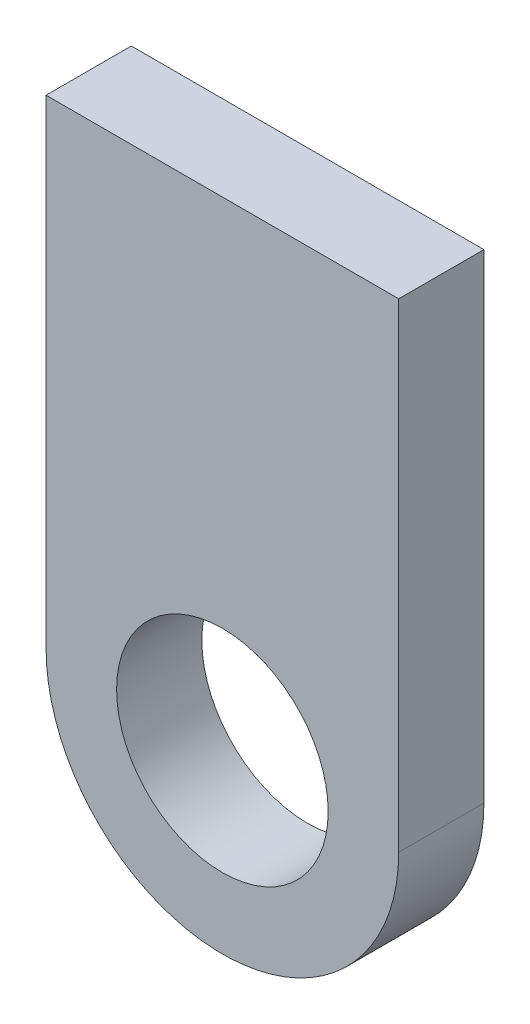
ISO-10303-21;
HEADER;
FILE_DESCRIPTION(('STEP AP214'),'2;1');
FILE_NAME('part.step','',(''),(''),'','','');
FILE_SCHEMA(('AUTOMOTIVE_DESIGN { 1 0 10303 214 1 1 1 1 }'));
ENDSEC;
DATA;
#1=APPLICATION_CONTEXT('core data for automotive mechanical design processes');
#2=APPLICATION_PROTOCOL_DEFINITION('international standard','automotive_design',2000,#1);
#3=PRODUCT_CONTEXT('',#1,'mechanical');
#4=PRODUCT('Part','Part','',(#3));
#5=PRODUCT_RELATED_PRODUCT_CATEGORY('part','',(#4));
#6=PRODUCT_DEFINITION_FORMATION('','',#4);
#7=PRODUCT_DEFINITION_CONTEXT('part definition',#1,'design');
#8=PRODUCT_DEFINITION('design','',#6,#7);
#9=PRODUCT_DEFINITION_SHAPE('','',#8);
#10=(LENGTH_UNIT() NAMED_UNIT(*) SI_UNIT(.MILLI.,.METRE.));
#11=(NAMED_UNIT(*) PLANE_ANGLE_UNIT() SI_UNIT($,.RADIAN.));
#12=(NAMED_UNIT(*) SI_UNIT($,.STERADIAN.) SOLID_ANGLE_UNIT());
#13=UNCERTAINTY_MEASURE_WITH_UNIT(LENGTH_MEASURE(1.E-05),#10,'distance_accuracy_value','');
#14=(GEOMETRIC_REPRESENTATION_CONTEXT(3) GLOBAL_UNCERTAINTY_ASSIGNED_CONTEXT((#13)) GLOBAL_UNIT_ASSIGNED_CONTEXT((#10,
#11,#12)) REPRESENTATION_CONTEXT('',''));
#15=CARTESIAN_POINT('',(0.,0.,0.));
#16=DIRECTION('',(0.,0.,1.));
#17=DIRECTION('',(1.,0.,0.));
#18=AXIS2_PLACEMENT_3D('',#15,#16,#17);
#19=CARTESIAN_POINT('',(0.,0.,29.));
#20=DIRECTION('',(0.,0.,1.));
#21=DIRECTION('',(1.,0.,0.));
#22=AXIS2_PLACEMENT_3D('',#19,#20,#21);
#23=PLANE('',#22);
#24=CARTESIAN_POINT('',(0.,0.,29.));
#25=DIRECTION('',(0.,0.,1.));
#26=DIRECTION('',(1.,0.,0.));
#27=AXIS2_PLACEMENT_3D('',#24,#25,#26);
#28=CIRCLE('',#27,60.);
#29=CARTESIAN_POINT('',(-60.,0.,29.));
#30=VERTEX_POINT('',#29);
#31=CARTESIAN_POINT('',(60.,0.,29.));
#32=VERTEX_POINT('',#31);
#33=EDGE_CURVE('E107',#30,#32,#28,.T.);
#34=ORIENTED_EDGE('',*,*,#33,.T.);
#35=DIRECTION('',(0.,1.,0.));
#36=VECTOR('',#35,1.);
#37=CARTESIAN_POINT('',(60.,0.,29.));
#38=LINE('',#37,#36);
#39=CARTESIAN_POINT('',(60.,163.10048208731,29.));
#40=VERTEX_POINT('',#39);
#41=EDGE_CURVE('E92',#32,#40,#38,.T.);
#42=ORIENTED_EDGE('',*,*,#41,.T.);
#43=DIRECTION('',(-1.,0.,0.));
#44=VECTOR('',#43,1.);
#45=CARTESIAN_POINT('',(-60.,163.10048208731,29.));
#46=LINE('',#45,#44);
#47=CARTESIAN_POINT('',(-60.,163.10048208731,29.));
#48=VERTEX_POINT('',#47);
#49=EDGE_CURVE('E58',#40,#48,#46,.T.);
#50=ORIENTED_EDGE('',*,*,#49,.T.);
#51=DIRECTION('',(0.,-1.,0.));
#52=VECTOR('',#51,1.);
#53=CARTESIAN_POINT('',(-60.,0.,29.));
#54=LINE('',#53,#52);
#55=EDGE_CURVE('E53',#48,#30,#54,.T.);
#56=ORIENTED_EDGE('',*,*,#55,.T.);
#57=EDGE_LOOP('',(#34,#42,#50,#56));
#58=FACE_BOUND('',#57,.T.);
#59=CARTESIAN_POINT('',(0.,0.,29.));
#60=DIRECTION('',(0.,0.,1.));
#61=DIRECTION('',(1.,0.,0.));
#62=AXIS2_PLACEMENT_3D('',#59,#60,#61);
#63=CIRCLE('',#62,36.);
#64=CARTESIAN_POINT('',(-36.,0.,29.));
#65=VERTEX_POINT('',#64);
#66=EDGE_CURVE('E97',#65,#65,#63,.T.);
#67=ORIENTED_EDGE('',*,*,#66,.F.);
#68=EDGE_LOOP('',(#67));
#69=FACE_BOUND('',#68,.T.);
#70=ADVANCED_FACE('F38',(#58,#69),#23,.T.);
#71=CARTESIAN_POINT('',(0.,0.,0.));
#72=DIRECTION('',(0.,0.,1.));
#73=DIRECTION('',(1.,0.,0.));
#74=AXIS2_PLACEMENT_3D('',#71,#72,#73);
#75=PLANE('',#74);
#76=CARTESIAN_POINT('',(0.,0.,0.));
#77=DIRECTION('',(0.,0.,1.));
#78=DIRECTION('',(1.,0.,0.));
#79=AXIS2_PLACEMENT_3D('',#76,#77,#78);
#80=CIRCLE('',#79,60.);
#81=CARTESIAN_POINT('',(-60.,0.,0.));
#82=VERTEX_POINT('',#81);
#83=CARTESIAN_POINT('',(60.,0.,0.));
#84=VERTEX_POINT('',#83);
#85=EDGE_CURVE('E84',#82,#84,#80,.T.);
#86=ORIENTED_EDGE('',*,*,#85,.F.);
#87=DIRECTION('',(0.,-1.,0.));
#88=VECTOR('',#87,1.);
#89=CARTESIAN_POINT('',(-60.,0.,0.));
#90=LINE('',#89,#88);
#91=CARTESIAN_POINT('',(-60.,163.10048208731,0.));
#92=VERTEX_POINT('',#91);
#93=EDGE_CURVE('E105',#92,#82,#90,.T.);
#94=ORIENTED_EDGE('',*,*,#93,.F.);
#95=DIRECTION('',(-1.,0.,0.));
#96=VECTOR('',#95,1.);
#97=CARTESIAN_POINT('',(-60.,163.10048208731,0.));
#98=LINE('',#97,#96);
#99=CARTESIAN_POINT('',(60.,163.10048208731,0.));
#100=VERTEX_POINT('',#99);
#101=EDGE_CURVE('E85',#100,#92,#98,.T.);
#102=ORIENTED_EDGE('',*,*,#101,.F.);
#103=DIRECTION('',(0.,1.,0.));
#104=VECTOR('',#103,1.);
#105=CARTESIAN_POINT('',(60.,0.,0.));
#106=LINE('',#105,#104);
#107=EDGE_CURVE('E79',#84,#100,#106,.T.);
#108=ORIENTED_EDGE('',*,*,#107,.F.);
#109=EDGE_LOOP('',(#86,#94,#102,#108));
#110=FACE_BOUND('',#109,.T.);
#111=CARTESIAN_POINT('',(0.,0.,0.));
#112=DIRECTION('',(0.,0.,1.));
#113=DIRECTION('',(1.,0.,0.));
#114=AXIS2_PLACEMENT_3D('',#111,#112,#113);
#115=CIRCLE('',#114,36.);
#116=CARTESIAN_POINT('',(-36.,0.,0.));
#117=VERTEX_POINT('',#116);
#118=EDGE_CURVE('E100',#117,#117,#115,.T.);
#119=ORIENTED_EDGE('',*,*,#118,.T.);
#120=EDGE_LOOP('',(#119));
#121=FACE_BOUND('',#120,.T.);
#122=ADVANCED_FACE('F80',(#110,#121),#75,.F.);
#123=CARTESIAN_POINT('',(0.,0.,29.));
#124=DIRECTION('',(0.,0.,-1.));
#125=DIRECTION('',(-1.,0.,0.));
#126=AXIS2_PLACEMENT_3D('',#123,#124,#125);
#127=CYLINDRICAL_SURFACE('',#126,60.);
#128=ORIENTED_EDGE('',*,*,#85,.T.);
#129=DIRECTION('',(0.,0.,-1.));
#130=VECTOR('',#129,1.);
#131=CARTESIAN_POINT('',(60.,0.,29.));
#132=LINE('',#131,#130);
#133=EDGE_CURVE('E11',#32,#84,#132,.T.);
#134=ORIENTED_EDGE('',*,*,#133,.F.);
#135=ORIENTED_EDGE('',*,*,#33,.F.);
#136=DIRECTION('',(0.,0.,-1.));
#137=VECTOR('',#136,1.);
#138=CARTESIAN_POINT('',(-60.,0.,29.));
#139=LINE('',#138,#137);
#140=EDGE_CURVE('E96',#30,#82,#139,.T.);
#141=ORIENTED_EDGE('',*,*,#140,.T.);
#142=EDGE_LOOP('',(#128,#134,#135,#141));
#143=FACE_BOUND('',#142,.T.);
#144=ADVANCED_FACE('F40',(#143),#127,.T.);
#145=CARTESIAN_POINT('',(60.,0.,29.));
#146=DIRECTION('',(-1.,0.,0.));
#147=DIRECTION('',(0.,0.,1.));
#148=AXIS2_PLACEMENT_3D('',#145,#146,#147);
#149=PLANE('',#148);
#150=ORIENTED_EDGE('',*,*,#107,.T.);
#151=DIRECTION('',(0.,0.,-1.));
#152=VECTOR('',#151,1.);
#153=CARTESIAN_POINT('',(60.,163.10048208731,29.));
#154=LINE('',#153,#152);
#155=EDGE_CURVE('E46',#40,#100,#154,.T.);
#156=ORIENTED_EDGE('',*,*,#155,.F.);
#157=ORIENTED_EDGE('',*,*,#41,.F.);
#158=ORIENTED_EDGE('',*,*,#133,.T.);
#159=EDGE_LOOP('',(#150,#156,#157,#158));
#160=FACE_BOUND('',#159,.T.);
#161=ADVANCED_FACE('F91',(#160),#149,.F.);
#162=CARTESIAN_POINT('',(-60.,163.10048208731,29.));
#163=DIRECTION('',(0.,-1.,0.));
#164=DIRECTION('',(0.,0.,-1.));
#165=AXIS2_PLACEMENT_3D('',#162,#163,#164);
#166=PLANE('',#165);
#167=ORIENTED_EDGE('',*,*,#101,.T.);
#168=DIRECTION('',(0.,0.,-1.));
#169=VECTOR('',#168,1.);
#170=CARTESIAN_POINT('',(-60.,163.10048208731,29.));
#171=LINE('',#170,#169);
#172=EDGE_CURVE('E113',#48,#92,#171,.T.);
#173=ORIENTED_EDGE('',*,*,#172,.F.);
#174=ORIENTED_EDGE('',*,*,#49,.F.);
#175=ORIENTED_EDGE('',*,*,#155,.T.);
#176=EDGE_LOOP('',(#167,#173,#174,#175));
#177=FACE_BOUND('',#176,.T.);
#178=ADVANCED_FACE('F116',(#177),#166,.F.);
#179=CARTESIAN_POINT('',(-60.,0.,29.));
#180=DIRECTION('',(1.,0.,0.));
#181=DIRECTION('',(0.,0.,-1.));
#182=AXIS2_PLACEMENT_3D('',#179,#180,#181);
#183=PLANE('',#182);
#184=ORIENTED_EDGE('',*,*,#93,.T.);
#185=ORIENTED_EDGE('',*,*,#140,.F.);
#186=ORIENTED_EDGE('',*,*,#55,.F.);
#187=ORIENTED_EDGE('',*,*,#172,.T.);
#188=EDGE_LOOP('',(#184,#185,#186,#187));
#189=FACE_BOUND('',#188,.T.);
#190=ADVANCED_FACE('F118',(#189),#183,.F.);
#191=CARTESIAN_POINT('',(0.,0.,29.));
#192=DIRECTION('',(0.,0.,-1.));
#193=DIRECTION('',(-1.,0.,0.));
#194=AXIS2_PLACEMENT_3D('',#191,#192,#193);
#195=CYLINDRICAL_SURFACE('',#194,36.);
#196=CARTESIAN_POINT('',(-36.,0.,29.));
#197=CARTESIAN_POINT('',(-36.,0.,28.6979166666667));
#198=CARTESIAN_POINT('',(-36.,0.,28.3958333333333));
#199=CARTESIAN_POINT('',(-36.,0.,27.7916666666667));
#200=CARTESIAN_POINT('',(-36.,0.,27.4895833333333));
#201=CARTESIAN_POINT('',(-36.,0.,26.8854166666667));
#202=CARTESIAN_POINT('',(-36.,0.,26.5833333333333));
#203=CARTESIAN_POINT('',(-36.,0.,25.9791666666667));
#204=CARTESIAN_POINT('',(-36.,0.,25.6770833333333));
#205=CARTESIAN_POINT('',(-36.,0.,25.0729166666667));
#206=CARTESIAN_POINT('',(-36.,0.,24.7708333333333));
#207=CARTESIAN_POINT('',(-36.,0.,24.1666666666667));
#208=CARTESIAN_POINT('',(-36.,0.,23.8645833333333));
#209=CARTESIAN_POINT('',(-36.,0.,23.2604166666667));
#210=CARTESIAN_POINT('',(-36.,0.,22.9583333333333));
#211=CARTESIAN_POINT('',(-36.,0.,22.3541666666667));
#212=CARTESIAN_POINT('',(-36.,0.,22.0520833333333));
#213=CARTESIAN_POINT('',(-36.,0.,21.4479166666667));
#214=CARTESIAN_POINT('',(-36.,0.,21.1458333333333));
#215=CARTESIAN_POINT('',(-36.,0.,20.5416666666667));
#216=CARTESIAN_POINT('',(-36.,0.,20.2395833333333));
#217=CARTESIAN_POINT('',(-36.,0.,19.6354166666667));
#218=CARTESIAN_POINT('',(-36.,0.,19.3333333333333));
#219=CARTESIAN_POINT('',(-36.,0.,18.7291666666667));
#220=CARTESIAN_POINT('',(-36.,0.,18.4270833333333));
#221=CARTESIAN_POINT('',(-36.,0.,17.8229166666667));
#222=CARTESIAN_POINT('',(-36.,0.,17.5208333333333));
#223=CARTESIAN_POINT('',(-36.,0.,16.9166666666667));
#224=CARTESIAN_POINT('',(-36.,0.,16.6145833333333));
#225=CARTESIAN_POINT('',(-36.,0.,16.0104166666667));
#226=CARTESIAN_POINT('',(-36.,0.,15.7083333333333));
#227=CARTESIAN_POINT('',(-36.,0.,15.1041666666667));
#228=CARTESIAN_POINT('',(-36.,0.,14.8020833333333));
#229=CARTESIAN_POINT('',(-36.,0.,14.1979166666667));
#230=CARTESIAN_POINT('',(-36.,0.,13.8958333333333));
#231=CARTESIAN_POINT('',(-36.,0.,13.2916666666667));
#232=CARTESIAN_POINT('',(-36.,0.,12.9895833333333));
#233=CARTESIAN_POINT('',(-36.,0.,12.3854166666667));
#234=CARTESIAN_POINT('',(-36.,0.,12.0833333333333));
#235=CARTESIAN_POINT('',(-36.,0.,11.4791666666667));
#236=CARTESIAN_POINT('',(-36.,0.,11.1770833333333));
#237=CARTESIAN_POINT('',(-36.,0.,10.5729166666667));
#238=CARTESIAN_POINT('',(-36.,0.,10.2708333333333));
#239=CARTESIAN_POINT('',(-36.,0.,9.66666666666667));
#240=CARTESIAN_POINT('',(-36.,0.,9.36458333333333));
#241=CARTESIAN_POINT('',(-36.,0.,8.76041666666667));
#242=CARTESIAN_POINT('',(-36.,0.,8.45833333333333));
#243=CARTESIAN_POINT('',(-36.,0.,7.85416666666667));
#244=CARTESIAN_POINT('',(-36.,0.,7.55208333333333));
#245=CARTESIAN_POINT('',(-36.,0.,6.94791666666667));
#246=CARTESIAN_POINT('',(-36.,0.,6.64583333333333));
#247=CARTESIAN_POINT('',(-36.,0.,6.04166666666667));
#248=CARTESIAN_POINT('',(-36.,0.,5.73958333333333));
#249=CARTESIAN_POINT('',(-36.,0.,5.13541666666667));
#250=CARTESIAN_POINT('',(-36.,0.,4.83333333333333));
#251=CARTESIAN_POINT('',(-36.,0.,4.22916666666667));
#252=CARTESIAN_POINT('',(-36.,0.,3.92708333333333));
#253=CARTESIAN_POINT('',(-36.,0.,3.32291666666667));
#254=CARTESIAN_POINT('',(-36.,0.,3.02083333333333));
#255=CARTESIAN_POINT('',(-36.,0.,2.41666666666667));
#256=CARTESIAN_POINT('',(-36.,0.,2.11458333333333));
#257=CARTESIAN_POINT('',(-36.,0.,1.51041666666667));
#258=CARTESIAN_POINT('',(-36.,0.,1.20833333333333));
#259=CARTESIAN_POINT('',(-36.,0.,0.604166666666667));
#260=CARTESIAN_POINT('',(-36.,0.,0.302083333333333));
#261=CARTESIAN_POINT('',(-36.,0.,0.));
#262=B_SPLINE_CURVE_WITH_KNOTS('',3,(#196,#197,#198,#199,#200,#201,#202,#203,#204,#205,#206,
#207,#208,#209,#210,#211,#212,#213,#214,#215,#216,#217,#218,#219,#220,#221,#222,#223,#224,#225,
#226,#227,#228,#229,#230,#231,#232,#233,#234,#235,#236,#237,#238,#239,#240,#241,#242,#243,#244,
#245,#246,#247,#248,#249,#250,#251,#252,#253,#254,#255,#256,#257,#258,#259,#260,#261),
.UNSPECIFIED.,.F.,.F.,(4,2,2,2,2,2,2,2,2,2,2,2,2,2,2,2,2,2,2,2,2,2,2,2,2,2,2,2,2,2,2,2,4),(0.,
0.906249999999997,1.8125,2.71875,3.625,4.53125,5.4375,6.34375,7.25,8.15625,9.0625,9.96875,
10.875,11.78125,12.6875,13.59375,14.5,15.40625,16.3125,17.21875,18.125,19.03125,19.9375,
20.84375,21.75,22.65625,23.5625,24.46875,25.375,26.28125,27.1875,28.09375,29.),.UNSPECIFIED.);
#263=EDGE_CURVE('BSEAM124',#65,#117,#262,.T.);
#264=ORIENTED_EDGE('',*,*,#66,.T.);
#265=ORIENTED_EDGE('',*,*,#118,.F.);
#266=ORIENTED_EDGE('',*,*,#263,.T.);
#267=ORIENTED_EDGE('',*,*,#263,.F.);
#268=EDGE_LOOP('',(#264,#266,#265,#267));
#269=FACE_BOUND('',#268,.T.);
#270=ADVANCED_FACE('F124',(#269),#195,.F.);
#271=CLOSED_SHELL('',(#70,#122,#144,#161,#178,#190,#270));
#272=MANIFOLD_SOLID_BREP('B2',#271);
#273=ADVANCED_BREP_SHAPE_REPRESENTATION('',(#18,#272),#14);
#274=SHAPE_DEFINITION_REPRESENTATION(#9,#273);
ENDSEC;
END-ISO-10303-21;
